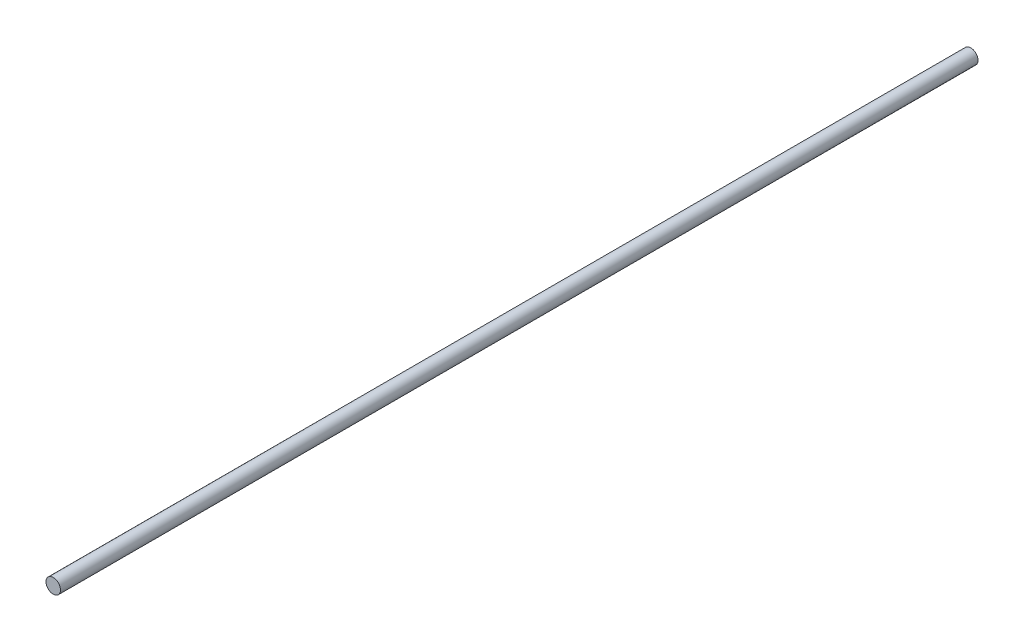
from build123d import *

# Parameters (mm, degrees)
SKETCH1_R           = 30
BOSS_EXTRUDE1_DEPTH = 3800


with BuildPart() as part:
    # Sketch1 → Boss-Extrude1 (new body)
    with BuildSketch(Plane.XY):
        Circle(SKETCH1_R)
    extrude(amount=-BOSS_EXTRUDE1_DEPTH)


solid = part.part
